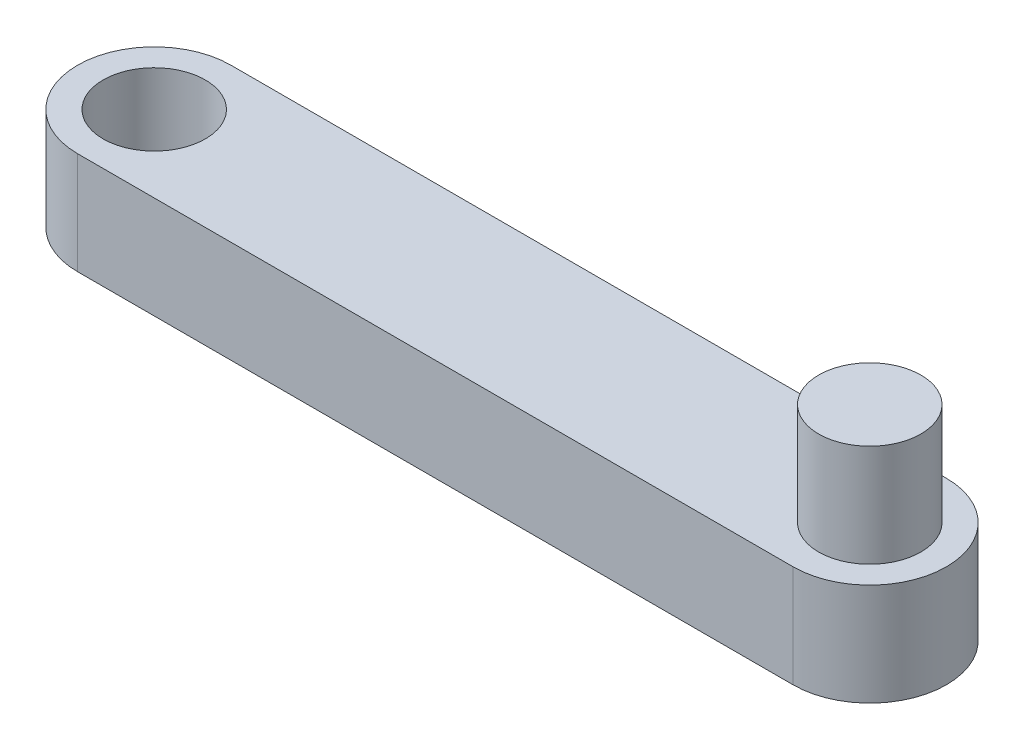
ISO-10303-21;
HEADER;
FILE_DESCRIPTION(('STEP AP214'),'2;1');
FILE_NAME('part.step','',(''),(''),'','','');
FILE_SCHEMA(('AUTOMOTIVE_DESIGN { 1 0 10303 214 1 1 1 1 }'));
ENDSEC;
DATA;
#1=APPLICATION_CONTEXT('core data for automotive mechanical design processes');
#2=APPLICATION_PROTOCOL_DEFINITION('international standard','automotive_design',2000,#1);
#3=PRODUCT_CONTEXT('',#1,'mechanical');
#4=PRODUCT('Part','Part','',(#3));
#5=PRODUCT_RELATED_PRODUCT_CATEGORY('part','',(#4));
#6=PRODUCT_DEFINITION_FORMATION('','',#4);
#7=PRODUCT_DEFINITION_CONTEXT('part definition',#1,'design');
#8=PRODUCT_DEFINITION('design','',#6,#7);
#9=PRODUCT_DEFINITION_SHAPE('','',#8);
#10=(LENGTH_UNIT() NAMED_UNIT(*) SI_UNIT(.MILLI.,.METRE.));
#11=(NAMED_UNIT(*) PLANE_ANGLE_UNIT() SI_UNIT($,.RADIAN.));
#12=(NAMED_UNIT(*) SI_UNIT($,.STERADIAN.) SOLID_ANGLE_UNIT());
#13=UNCERTAINTY_MEASURE_WITH_UNIT(LENGTH_MEASURE(1.E-05),#10,'distance_accuracy_value','');
#14=(GEOMETRIC_REPRESENTATION_CONTEXT(3) GLOBAL_UNCERTAINTY_ASSIGNED_CONTEXT((#13)) GLOBAL_UNIT_ASSIGNED_CONTEXT((#10,
#11,#12)) REPRESENTATION_CONTEXT('',''));
#15=CARTESIAN_POINT('',(0.,0.,0.));
#16=DIRECTION('',(0.,0.,1.));
#17=DIRECTION('',(1.,0.,0.));
#18=AXIS2_PLACEMENT_3D('',#15,#16,#17);
#19=CARTESIAN_POINT('',(0.,10.,0.));
#20=DIRECTION('',(0.,1.,0.));
#21=DIRECTION('',(0.,0.,1.));
#22=AXIS2_PLACEMENT_3D('',#19,#20,#21);
#23=PLANE('',#22);
#24=CARTESIAN_POINT('',(0.,10.,0.));
#25=DIRECTION('',(0.,1.,0.));
#26=DIRECTION('',(0.,0.,1.));
#27=AXIS2_PLACEMENT_3D('',#24,#25,#26);
#28=CIRCLE('',#27,5.);
#29=CARTESIAN_POINT('',(0.,10.,5.));
#30=VERTEX_POINT('',#29);
#31=EDGE_CURVE('E124',#30,#30,#28,.T.);
#32=ORIENTED_EDGE('',*,*,#31,.F.);
#33=EDGE_LOOP('',(#32));
#34=FACE_BOUND('',#33,.T.);
#35=CARTESIAN_POINT('',(0.,10.,0.));
#36=DIRECTION('',(0.,1.,0.));
#37=DIRECTION('',(0.,0.,1.));
#38=AXIS2_PLACEMENT_3D('',#35,#36,#37);
#39=CIRCLE('',#38,7.5);
#40=CARTESIAN_POINT('',(0.,10.,-7.5));
#41=VERTEX_POINT('',#40);
#42=CARTESIAN_POINT('',(0.,10.,7.5));
#43=VERTEX_POINT('',#42);
#44=EDGE_CURVE('E102',#41,#43,#39,.T.);
#45=ORIENTED_EDGE('',*,*,#44,.T.);
#46=DIRECTION('',(1.,0.,0.));
#47=VECTOR('',#46,1.);
#48=CARTESIAN_POINT('',(0.,10.,7.5));
#49=LINE('',#48,#47);
#50=CARTESIAN_POINT('',(70.,10.,7.5));
#51=VERTEX_POINT('',#50);
#52=EDGE_CURVE('E97',#43,#51,#49,.T.);
#53=ORIENTED_EDGE('',*,*,#52,.T.);
#54=CARTESIAN_POINT('',(70.,10.,0.));
#55=DIRECTION('',(0.,1.,0.));
#56=DIRECTION('',(0.,0.,1.));
#57=AXIS2_PLACEMENT_3D('',#54,#55,#56);
#58=CIRCLE('',#57,7.5);
#59=CARTESIAN_POINT('',(70.,10.,-7.5));
#60=VERTEX_POINT('',#59);
#61=EDGE_CURVE('E100',#51,#60,#58,.T.);
#62=ORIENTED_EDGE('',*,*,#61,.T.);
#63=DIRECTION('',(-1.,0.,0.));
#64=VECTOR('',#63,1.);
#65=CARTESIAN_POINT('',(0.,10.,-7.5));
#66=LINE('',#65,#64);
#67=EDGE_CURVE('E67',#60,#41,#66,.T.);
#68=ORIENTED_EDGE('',*,*,#67,.T.);
#69=EDGE_LOOP('',(#45,#53,#62,#68));
#70=FACE_BOUND('',#69,.T.);
#71=CARTESIAN_POINT('',(70.,10.,0.));
#72=DIRECTION('',(0.,1.,0.));
#73=DIRECTION('',(0.,0.,1.));
#74=AXIS2_PLACEMENT_3D('',#71,#72,#73);
#75=CIRCLE('',#74,5.);
#76=CARTESIAN_POINT('',(70.,10.,5.));
#77=VERTEX_POINT('',#76);
#78=EDGE_CURVE('E148',#77,#77,#75,.T.);
#79=ORIENTED_EDGE('',*,*,#78,.F.);
#80=EDGE_LOOP('',(#79));
#81=FACE_BOUND('',#80,.T.);
#82=ADVANCED_FACE('F49',(#34,#70,#81),#23,.T.);
#83=CARTESIAN_POINT('',(0.,0.,0.));
#84=DIRECTION('',(0.,1.,0.));
#85=DIRECTION('',(0.,0.,1.));
#86=AXIS2_PLACEMENT_3D('',#83,#84,#85);
#87=PLANE('',#86);
#88=CARTESIAN_POINT('',(0.,0.,0.));
#89=DIRECTION('',(0.,1.,0.));
#90=DIRECTION('',(0.,0.,1.));
#91=AXIS2_PLACEMENT_3D('',#88,#89,#90);
#92=CIRCLE('',#91,7.5);
#93=CARTESIAN_POINT('',(0.,0.,-7.5));
#94=VERTEX_POINT('',#93);
#95=CARTESIAN_POINT('',(0.,0.,7.5));
#96=VERTEX_POINT('',#95);
#97=EDGE_CURVE('E120',#94,#96,#92,.T.);
#98=ORIENTED_EDGE('',*,*,#97,.F.);
#99=DIRECTION('',(-1.,0.,0.));
#100=VECTOR('',#99,1.);
#101=CARTESIAN_POINT('',(0.,0.,-7.5));
#102=LINE('',#101,#100);
#103=CARTESIAN_POINT('',(70.,0.,-7.5));
#104=VERTEX_POINT('',#103);
#105=EDGE_CURVE('E90',#104,#94,#102,.T.);
#106=ORIENTED_EDGE('',*,*,#105,.F.);
#107=CARTESIAN_POINT('',(70.,0.,0.));
#108=DIRECTION('',(0.,1.,0.));
#109=DIRECTION('',(0.,0.,1.));
#110=AXIS2_PLACEMENT_3D('',#107,#108,#109);
#111=CIRCLE('',#110,7.5);
#112=CARTESIAN_POINT('',(70.,0.,7.5));
#113=VERTEX_POINT('',#112);
#114=EDGE_CURVE('E84',#113,#104,#111,.T.);
#115=ORIENTED_EDGE('',*,*,#114,.F.);
#116=DIRECTION('',(1.,0.,0.));
#117=VECTOR('',#116,1.);
#118=CARTESIAN_POINT('',(0.,0.,7.5));
#119=LINE('',#118,#117);
#120=EDGE_CURVE('E107',#96,#113,#119,.T.);
#121=ORIENTED_EDGE('',*,*,#120,.F.);
#122=EDGE_LOOP('',(#98,#106,#115,#121));
#123=FACE_BOUND('',#122,.T.);
#124=CARTESIAN_POINT('',(0.,0.,0.));
#125=DIRECTION('',(0.,1.,0.));
#126=DIRECTION('',(0.,0.,1.));
#127=AXIS2_PLACEMENT_3D('',#124,#125,#126);
#128=CIRCLE('',#127,5.);
#129=CARTESIAN_POINT('',(0.,0.,5.));
#130=VERTEX_POINT('',#129);
#131=EDGE_CURVE('E144',#130,#130,#128,.T.);
#132=ORIENTED_EDGE('',*,*,#131,.T.);
#133=EDGE_LOOP('',(#132));
#134=FACE_BOUND('',#133,.T.);
#135=ADVANCED_FACE('F138',(#123,#134),#87,.F.);
#136=CARTESIAN_POINT('',(0.,10.,0.));
#137=DIRECTION('',(0.,-1.,0.));
#138=DIRECTION('',(0.,0.,-1.));
#139=AXIS2_PLACEMENT_3D('',#136,#137,#138);
#140=CYLINDRICAL_SURFACE('',#139,7.5);
#141=ORIENTED_EDGE('',*,*,#97,.T.);
#142=DIRECTION('',(0.,-1.,0.));
#143=VECTOR('',#142,1.);
#144=CARTESIAN_POINT('',(0.,10.,7.5));
#145=LINE('',#144,#143);
#146=EDGE_CURVE('E11',#43,#96,#145,.T.);
#147=ORIENTED_EDGE('',*,*,#146,.F.);
#148=ORIENTED_EDGE('',*,*,#44,.F.);
#149=DIRECTION('',(0.,-1.,0.));
#150=VECTOR('',#149,1.);
#151=CARTESIAN_POINT('',(0.,10.,-7.5));
#152=LINE('',#151,#150);
#153=EDGE_CURVE('E116',#41,#94,#152,.T.);
#154=ORIENTED_EDGE('',*,*,#153,.T.);
#155=EDGE_LOOP('',(#141,#147,#148,#154));
#156=FACE_BOUND('',#155,.T.);
#157=ADVANCED_FACE('F51',(#156),#140,.T.);
#158=CARTESIAN_POINT('',(0.,10.,7.5));
#159=DIRECTION('',(0.,0.,-1.));
#160=DIRECTION('',(-1.,0.,0.));
#161=AXIS2_PLACEMENT_3D('',#158,#159,#160);
#162=PLANE('',#161);
#163=ORIENTED_EDGE('',*,*,#120,.T.);
#164=DIRECTION('',(0.,-1.,0.));
#165=VECTOR('',#164,1.);
#166=CARTESIAN_POINT('',(70.,10.,7.5));
#167=LINE('',#166,#165);
#168=EDGE_CURVE('E59',#51,#113,#167,.T.);
#169=ORIENTED_EDGE('',*,*,#168,.F.);
#170=ORIENTED_EDGE('',*,*,#52,.F.);
#171=ORIENTED_EDGE('',*,*,#146,.T.);
#172=EDGE_LOOP('',(#163,#169,#170,#171));
#173=FACE_BOUND('',#172,.T.);
#174=ADVANCED_FACE('F106',(#173),#162,.F.);
#175=CARTESIAN_POINT('',(70.,10.,0.));
#176=DIRECTION('',(0.,-1.,0.));
#177=DIRECTION('',(0.,0.,-1.));
#178=AXIS2_PLACEMENT_3D('',#175,#176,#177);
#179=CYLINDRICAL_SURFACE('',#178,7.5);
#180=ORIENTED_EDGE('',*,*,#114,.T.);
#181=DIRECTION('',(0.,-1.,0.));
#182=VECTOR('',#181,1.);
#183=CARTESIAN_POINT('',(70.,10.,-7.5));
#184=LINE('',#183,#182);
#185=EDGE_CURVE('E109',#60,#104,#184,.T.);
#186=ORIENTED_EDGE('',*,*,#185,.F.);
#187=ORIENTED_EDGE('',*,*,#61,.F.);
#188=ORIENTED_EDGE('',*,*,#168,.T.);
#189=EDGE_LOOP('',(#180,#186,#187,#188));
#190=FACE_BOUND('',#189,.T.);
#191=ADVANCED_FACE('F110',(#190),#179,.T.);
#192=CARTESIAN_POINT('',(0.,10.,-7.5));
#193=DIRECTION('',(0.,0.,1.));
#194=DIRECTION('',(1.,0.,0.));
#195=AXIS2_PLACEMENT_3D('',#192,#193,#194);
#196=PLANE('',#195);
#197=ORIENTED_EDGE('',*,*,#105,.T.);
#198=ORIENTED_EDGE('',*,*,#153,.F.);
#199=ORIENTED_EDGE('',*,*,#67,.F.);
#200=ORIENTED_EDGE('',*,*,#185,.T.);
#201=EDGE_LOOP('',(#197,#198,#199,#200));
#202=FACE_BOUND('',#201,.T.);
#203=ADVANCED_FACE('F135',(#202),#196,.F.);
#204=CARTESIAN_POINT('',(0.,10.,0.));
#205=DIRECTION('',(0.,-1.,0.));
#206=DIRECTION('',(0.,0.,-1.));
#207=AXIS2_PLACEMENT_3D('',#204,#205,#206);
#208=CYLINDRICAL_SURFACE('',#207,5.);
#209=ORIENTED_EDGE('',*,*,#31,.T.);
#210=EDGE_LOOP('',(#209));
#211=FACE_BOUND('',#210,.T.);
#212=ORIENTED_EDGE('',*,*,#131,.F.);
#213=EDGE_LOOP('',(#212));
#214=FACE_BOUND('',#213,.T.);
#215=ADVANCED_FACE('F164',(#211,#214),#208,.F.);
#216=CARTESIAN_POINT('',(70.,20.,0.));
#217=DIRECTION('',(0.,-1.,0.));
#218=DIRECTION('',(0.,0.,-1.));
#219=AXIS2_PLACEMENT_3D('',#216,#217,#218);
#220=CYLINDRICAL_SURFACE('',#219,5.);
#221=ORIENTED_EDGE('',*,*,#78,.T.);
#222=EDGE_LOOP('',(#221));
#223=FACE_BOUND('',#222,.T.);
#224=CARTESIAN_POINT('',(70.,20.,0.));
#225=DIRECTION('',(0.,1.,0.));
#226=DIRECTION('',(0.,0.,1.));
#227=AXIS2_PLACEMENT_3D('',#224,#225,#226);
#228=CIRCLE('',#227,5.);
#229=CARTESIAN_POINT('',(70.,20.,5.));
#230=VERTEX_POINT('',#229);
#231=EDGE_CURVE('E154',#230,#230,#228,.T.);
#232=ORIENTED_EDGE('',*,*,#231,.F.);
#233=EDGE_LOOP('',(#232));
#234=FACE_BOUND('',#233,.T.);
#235=ADVANCED_FACE('F162',(#223,#234),#220,.T.);
#236=CARTESIAN_POINT('',(0.,20.,0.));
#237=DIRECTION('',(0.,1.,0.));
#238=DIRECTION('',(0.,0.,1.));
#239=AXIS2_PLACEMENT_3D('',#236,#237,#238);
#240=PLANE('',#239);
#241=ORIENTED_EDGE('',*,*,#231,.T.);
#242=EDGE_LOOP('',(#241));
#243=FACE_BOUND('',#242,.T.);
#244=ADVANCED_FACE('F160',(#243),#240,.T.);
#245=CLOSED_SHELL('',(#82,#135,#157,#174,#191,#203,#215,#235,#244));
#246=MANIFOLD_SOLID_BREP('B2',#245);
#247=ADVANCED_BREP_SHAPE_REPRESENTATION('',(#18,#246),#14);
#248=SHAPE_DEFINITION_REPRESENTATION(#9,#247);
ENDSEC;
END-ISO-10303-21;
